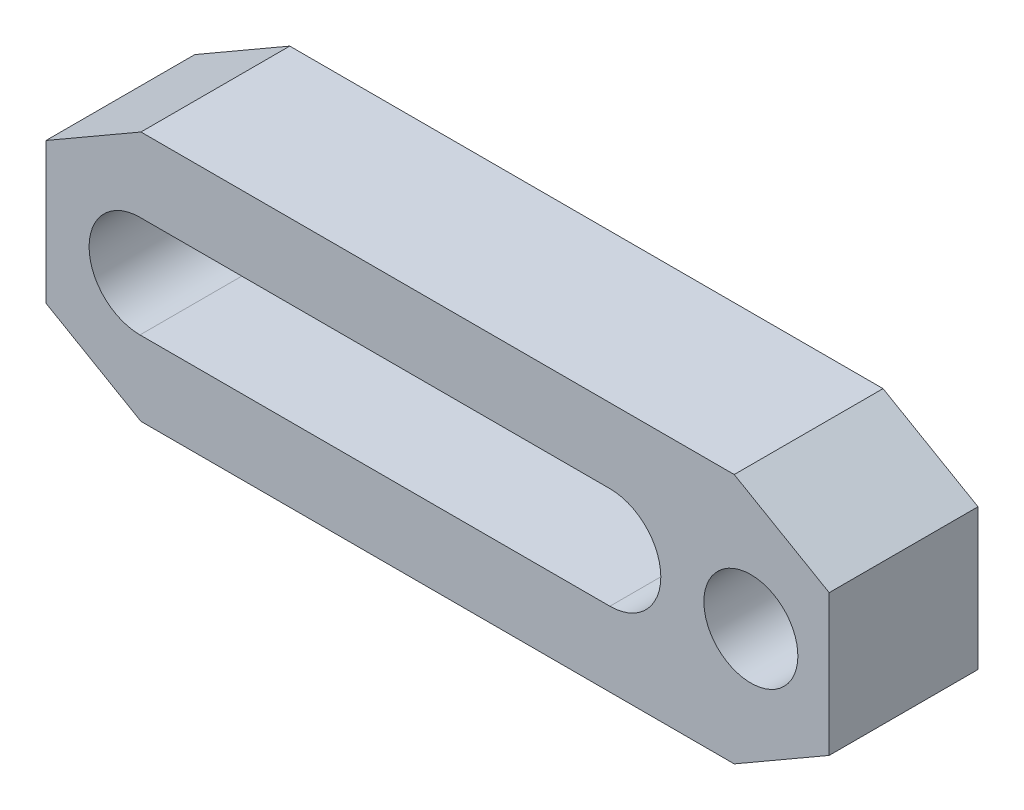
ISO-10303-21;
HEADER;
FILE_DESCRIPTION(('STEP AP214'),'2;1');
FILE_NAME('part.step','',(''),(''),'','','');
FILE_SCHEMA(('AUTOMOTIVE_DESIGN { 1 0 10303 214 1 1 1 1 }'));
ENDSEC;
DATA;
#1=APPLICATION_CONTEXT('core data for automotive mechanical design processes');
#2=APPLICATION_PROTOCOL_DEFINITION('international standard','automotive_design',2000,#1);
#3=PRODUCT_CONTEXT('',#1,'mechanical');
#4=PRODUCT('Part','Part','',(#3));
#5=PRODUCT_RELATED_PRODUCT_CATEGORY('part','',(#4));
#6=PRODUCT_DEFINITION_FORMATION('','',#4);
#7=PRODUCT_DEFINITION_CONTEXT('part definition',#1,'design');
#8=PRODUCT_DEFINITION('design','',#6,#7);
#9=PRODUCT_DEFINITION_SHAPE('','',#8);
#10=(LENGTH_UNIT() NAMED_UNIT(*) SI_UNIT(.MILLI.,.METRE.));
#11=(NAMED_UNIT(*) PLANE_ANGLE_UNIT() SI_UNIT($,.RADIAN.));
#12=(NAMED_UNIT(*) SI_UNIT($,.STERADIAN.) SOLID_ANGLE_UNIT());
#13=UNCERTAINTY_MEASURE_WITH_UNIT(LENGTH_MEASURE(1.E-05),#10,'distance_accuracy_value','');
#14=(GEOMETRIC_REPRESENTATION_CONTEXT(3) GLOBAL_UNCERTAINTY_ASSIGNED_CONTEXT((#13)) GLOBAL_UNIT_ASSIGNED_CONTEXT((#10,
#11,#12)) REPRESENTATION_CONTEXT('',''));
#15=CARTESIAN_POINT('',(0.,0.,0.));
#16=DIRECTION('',(0.,0.,1.));
#17=DIRECTION('',(1.,0.,0.));
#18=AXIS2_PLACEMENT_3D('',#15,#16,#17);
#19=CARTESIAN_POINT('',(-22.,37.8675134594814,19.));
#20=DIRECTION('',(0.,0.,1.));
#21=DIRECTION('',(0.,1.,0.));
#22=AXIS2_PLACEMENT_3D('',#19,#20,#21);
#23=PLANE('',#22);
#24=CARTESIAN_POINT('',(18.,0.,19.));
#25=DIRECTION('',(0.,0.,1.));
#26=DIRECTION('',(0.,1.,0.));
#27=AXIS2_PLACEMENT_3D('',#24,#25,#26);
#28=CIRCLE('',#27,6.);
#29=CARTESIAN_POINT('',(18.,6.,19.));
#30=VERTEX_POINT('',#29);
#31=EDGE_CURVE('E124',#30,#30,#28,.T.);
#32=ORIENTED_EDGE('',*,*,#31,.F.);
#33=EDGE_LOOP('',(#32));
#34=FACE_BOUND('',#33,.T.);
#35=DIRECTION('',(-0.866025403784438,-0.5,0.));
#36=VECTOR('',#35,1.);
#37=CARTESIAN_POINT('',(-72.,9.,19.));
#38=LINE('',#37,#36);
#39=CARTESIAN_POINT('',(-59.8756443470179,16.,19.));
#40=VERTEX_POINT('',#39);
#41=CARTESIAN_POINT('',(-72.,9.,19.));
#42=VERTEX_POINT('',#41);
#43=EDGE_CURVE('E160',#40,#42,#38,.T.);
#44=ORIENTED_EDGE('',*,*,#43,.T.);
#45=DIRECTION('',(0.,-1.,0.));
#46=VECTOR('',#45,1.);
#47=CARTESIAN_POINT('',(-72.,-9.,19.));
#48=LINE('',#47,#46);
#49=CARTESIAN_POINT('',(-72.,-9.,19.));
#50=VERTEX_POINT('',#49);
#51=EDGE_CURVE('E163',#42,#50,#48,.T.);
#52=ORIENTED_EDGE('',*,*,#51,.T.);
#53=DIRECTION('',(0.866025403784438,-0.5,0.));
#54=VECTOR('',#53,1.);
#55=CARTESIAN_POINT('',(-72.,-9.,19.));
#56=LINE('',#55,#54);
#57=CARTESIAN_POINT('',(-59.8756443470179,-16.,19.));
#58=VERTEX_POINT('',#57);
#59=EDGE_CURVE('E165',#50,#58,#56,.T.);
#60=ORIENTED_EDGE('',*,*,#59,.T.);
#61=DIRECTION('',(1.,0.,0.));
#62=VECTOR('',#61,1.);
#63=CARTESIAN_POINT('',(15.8756443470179,-16.,19.));
#64=LINE('',#63,#62);
#65=CARTESIAN_POINT('',(15.8756443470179,-16.,19.));
#66=VERTEX_POINT('',#65);
#67=EDGE_CURVE('E167',#58,#66,#64,.T.);
#68=ORIENTED_EDGE('',*,*,#67,.T.);
#69=DIRECTION('',(0.866025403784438,0.5,0.));
#70=VECTOR('',#69,1.);
#71=CARTESIAN_POINT('',(28.,-9.,19.));
#72=LINE('',#71,#70);
#73=CARTESIAN_POINT('',(28.,-9.,19.));
#74=VERTEX_POINT('',#73);
#75=EDGE_CURVE('E169',#66,#74,#72,.T.);
#76=ORIENTED_EDGE('',*,*,#75,.T.);
#77=DIRECTION('',(0.,1.,0.));
#78=VECTOR('',#77,1.);
#79=CARTESIAN_POINT('',(28.,-9.,19.));
#80=LINE('',#79,#78);
#81=CARTESIAN_POINT('',(28.,9.,19.));
#82=VERTEX_POINT('',#81);
#83=EDGE_CURVE('E171',#74,#82,#80,.T.);
#84=ORIENTED_EDGE('',*,*,#83,.T.);
#85=DIRECTION('',(-0.866025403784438,0.5,0.));
#86=VECTOR('',#85,1.);
#87=CARTESIAN_POINT('',(28.,9.,19.));
#88=LINE('',#87,#86);
#89=CARTESIAN_POINT('',(15.8756443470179,16.,19.));
#90=VERTEX_POINT('',#89);
#91=EDGE_CURVE('E173',#82,#90,#88,.T.);
#92=ORIENTED_EDGE('',*,*,#91,.T.);
#93=DIRECTION('',(-1.,0.,0.));
#94=VECTOR('',#93,1.);
#95=CARTESIAN_POINT('',(15.8756443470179,16.,19.));
#96=LINE('',#95,#94);
#97=EDGE_CURVE('E175',#90,#40,#96,.T.);
#98=ORIENTED_EDGE('',*,*,#97,.T.);
#99=EDGE_LOOP('',(#44,#52,#60,#68,#76,#84,#92,#98));
#100=FACE_BOUND('',#99,.T.);
#101=DIRECTION('',(-1.,0.,0.));
#102=VECTOR('',#101,1.);
#103=CARTESIAN_POINT('',(0.,6.5,19.));
#104=LINE('',#103,#102);
#105=CARTESIAN_POINT('',(0.,6.5,19.));
#106=VERTEX_POINT('',#105);
#107=CARTESIAN_POINT('',(-60.,6.5,19.));
#108=VERTEX_POINT('',#107);
#109=EDGE_CURVE('E134',#106,#108,#104,.T.);
#110=ORIENTED_EDGE('',*,*,#109,.F.);
#111=CARTESIAN_POINT('',(0.,0.,19.));
#112=DIRECTION('',(0.,0.,1.));
#113=DIRECTION('',(0.,1.,0.));
#114=AXIS2_PLACEMENT_3D('',#111,#112,#113);
#115=CIRCLE('',#114,6.5);
#116=CARTESIAN_POINT('',(0.,-6.5,19.));
#117=VERTEX_POINT('',#116);
#118=EDGE_CURVE('E118',#117,#106,#115,.T.);
#119=ORIENTED_EDGE('',*,*,#118,.F.);
#120=DIRECTION('',(1.,0.,0.));
#121=VECTOR('',#120,1.);
#122=CARTESIAN_POINT('',(0.,-6.5,19.));
#123=LINE('',#122,#121);
#124=CARTESIAN_POINT('',(-60.,-6.5,19.));
#125=VERTEX_POINT('',#124);
#126=EDGE_CURVE('E138',#125,#117,#123,.T.);
#127=ORIENTED_EDGE('',*,*,#126,.F.);
#128=CARTESIAN_POINT('',(-60.,0.,19.));
#129=DIRECTION('',(0.,0.,1.));
#130=DIRECTION('',(0.,1.,0.));
#131=AXIS2_PLACEMENT_3D('',#128,#129,#130);
#132=CIRCLE('',#131,6.5);
#133=EDGE_CURVE('E136',#108,#125,#132,.T.);
#134=ORIENTED_EDGE('',*,*,#133,.F.);
#135=EDGE_LOOP('',(#110,#119,#127,#134));
#136=FACE_BOUND('',#135,.T.);
#137=ADVANCED_FACE('F14',(#34,#100,#136),#23,.T.);
#138=CARTESIAN_POINT('',(-22.,37.8675134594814,0.));
#139=DIRECTION('',(0.,0.,1.));
#140=DIRECTION('',(0.,1.,0.));
#141=AXIS2_PLACEMENT_3D('',#138,#139,#140);
#142=PLANE('',#141);
#143=CARTESIAN_POINT('',(18.,0.,0.));
#144=DIRECTION('',(0.,0.,1.));
#145=DIRECTION('',(0.,1.,0.));
#146=AXIS2_PLACEMENT_3D('',#143,#144,#145);
#147=CIRCLE('',#146,6.);
#148=CARTESIAN_POINT('',(18.,6.,0.));
#149=VERTEX_POINT('',#148);
#150=EDGE_CURVE('E127',#149,#149,#147,.T.);
#151=ORIENTED_EDGE('',*,*,#150,.T.);
#152=EDGE_LOOP('',(#151));
#153=FACE_BOUND('',#152,.T.);
#154=DIRECTION('',(-0.866025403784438,-0.5,0.));
#155=VECTOR('',#154,1.);
#156=CARTESIAN_POINT('',(-72.,9.,0.));
#157=LINE('',#156,#155);
#158=CARTESIAN_POINT('',(-59.8756443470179,16.,0.));
#159=VERTEX_POINT('',#158);
#160=CARTESIAN_POINT('',(-72.,9.,0.));
#161=VERTEX_POINT('',#160);
#162=EDGE_CURVE('E119',#159,#161,#157,.T.);
#163=ORIENTED_EDGE('',*,*,#162,.F.);
#164=DIRECTION('',(-1.,0.,0.));
#165=VECTOR('',#164,1.);
#166=CARTESIAN_POINT('',(15.8756443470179,16.,0.));
#167=LINE('',#166,#165);
#168=CARTESIAN_POINT('',(15.8756443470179,16.,0.));
#169=VERTEX_POINT('',#168);
#170=EDGE_CURVE('E158',#169,#159,#167,.T.);
#171=ORIENTED_EDGE('',*,*,#170,.F.);
#172=DIRECTION('',(-0.866025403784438,0.5,0.));
#173=VECTOR('',#172,1.);
#174=CARTESIAN_POINT('',(28.,9.,0.));
#175=LINE('',#174,#173);
#176=CARTESIAN_POINT('',(28.,9.,0.));
#177=VERTEX_POINT('',#176);
#178=EDGE_CURVE('E156',#177,#169,#175,.T.);
#179=ORIENTED_EDGE('',*,*,#178,.F.);
#180=DIRECTION('',(0.,1.,0.));
#181=VECTOR('',#180,1.);
#182=CARTESIAN_POINT('',(28.,-9.,0.));
#183=LINE('',#182,#181);
#184=CARTESIAN_POINT('',(28.,-9.,0.));
#185=VERTEX_POINT('',#184);
#186=EDGE_CURVE('E154',#185,#177,#183,.T.);
#187=ORIENTED_EDGE('',*,*,#186,.F.);
#188=DIRECTION('',(0.866025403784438,0.5,0.));
#189=VECTOR('',#188,1.);
#190=CARTESIAN_POINT('',(28.,-9.,0.));
#191=LINE('',#190,#189);
#192=CARTESIAN_POINT('',(15.8756443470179,-16.,0.));
#193=VERTEX_POINT('',#192);
#194=EDGE_CURVE('E152',#193,#185,#191,.T.);
#195=ORIENTED_EDGE('',*,*,#194,.F.);
#196=DIRECTION('',(1.,0.,0.));
#197=VECTOR('',#196,1.);
#198=CARTESIAN_POINT('',(15.8756443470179,-16.,0.));
#199=LINE('',#198,#197);
#200=CARTESIAN_POINT('',(-59.8756443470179,-16.,0.));
#201=VERTEX_POINT('',#200);
#202=EDGE_CURVE('E150',#201,#193,#199,.T.);
#203=ORIENTED_EDGE('',*,*,#202,.F.);
#204=DIRECTION('',(0.866025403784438,-0.5,0.));
#205=VECTOR('',#204,1.);
#206=CARTESIAN_POINT('',(-72.,-9.,0.));
#207=LINE('',#206,#205);
#208=CARTESIAN_POINT('',(-72.,-9.,0.));
#209=VERTEX_POINT('',#208);
#210=EDGE_CURVE('E148',#209,#201,#207,.T.);
#211=ORIENTED_EDGE('',*,*,#210,.F.);
#212=DIRECTION('',(0.,-1.,0.));
#213=VECTOR('',#212,1.);
#214=CARTESIAN_POINT('',(-72.,-9.,0.));
#215=LINE('',#214,#213);
#216=EDGE_CURVE('E146',#161,#209,#215,.T.);
#217=ORIENTED_EDGE('',*,*,#216,.F.);
#218=EDGE_LOOP('',(#163,#171,#179,#187,#195,#203,#211,#217));
#219=FACE_BOUND('',#218,.T.);
#220=CARTESIAN_POINT('',(0.,0.,0.));
#221=DIRECTION('',(0.,0.,1.));
#222=DIRECTION('',(0.,1.,0.));
#223=AXIS2_PLACEMENT_3D('',#220,#221,#222);
#224=CIRCLE('',#223,6.5);
#225=CARTESIAN_POINT('',(0.,-6.5,0.));
#226=VERTEX_POINT('',#225);
#227=CARTESIAN_POINT('',(0.,6.5,0.));
#228=VERTEX_POINT('',#227);
#229=EDGE_CURVE('E37',#226,#228,#224,.T.);
#230=ORIENTED_EDGE('',*,*,#229,.T.);
#231=DIRECTION('',(-1.,0.,0.));
#232=VECTOR('',#231,1.);
#233=CARTESIAN_POINT('',(0.,6.5,0.));
#234=LINE('',#233,#232);
#235=CARTESIAN_POINT('',(-60.,6.5,0.));
#236=VERTEX_POINT('',#235);
#237=EDGE_CURVE('E105',#228,#236,#234,.T.);
#238=ORIENTED_EDGE('',*,*,#237,.T.);
#239=CARTESIAN_POINT('',(-60.,0.,0.));
#240=DIRECTION('',(0.,0.,1.));
#241=DIRECTION('',(0.,1.,0.));
#242=AXIS2_PLACEMENT_3D('',#239,#240,#241);
#243=CIRCLE('',#242,6.5);
#244=CARTESIAN_POINT('',(-60.,-6.5,0.));
#245=VERTEX_POINT('',#244);
#246=EDGE_CURVE('E114',#236,#245,#243,.T.);
#247=ORIENTED_EDGE('',*,*,#246,.T.);
#248=DIRECTION('',(1.,0.,0.));
#249=VECTOR('',#248,1.);
#250=CARTESIAN_POINT('',(0.,-6.5,0.));
#251=LINE('',#250,#249);
#252=EDGE_CURVE('E123',#245,#226,#251,.T.);
#253=ORIENTED_EDGE('',*,*,#252,.T.);
#254=EDGE_LOOP('',(#230,#238,#247,#253));
#255=FACE_BOUND('',#254,.T.);
#256=ADVANCED_FACE('F122',(#153,#219,#255),#142,.F.);
#257=CARTESIAN_POINT('',(-72.,9.,19.));
#258=DIRECTION('',(0.5,-0.866025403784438,0.));
#259=DIRECTION('',(0.866025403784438,0.5,0.));
#260=AXIS2_PLACEMENT_3D('',#257,#258,#259);
#261=PLANE('',#260);
#262=ORIENTED_EDGE('',*,*,#162,.T.);
#263=DIRECTION('',(0.,0.,-1.));
#264=VECTOR('',#263,1.);
#265=CARTESIAN_POINT('',(-72.,9.,19.));
#266=LINE('',#265,#264);
#267=EDGE_CURVE('E9',#42,#161,#266,.T.);
#268=ORIENTED_EDGE('',*,*,#267,.F.);
#269=ORIENTED_EDGE('',*,*,#43,.F.);
#270=DIRECTION('',(0.,0.,-1.));
#271=VECTOR('',#270,1.);
#272=CARTESIAN_POINT('',(-59.8756443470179,16.,19.));
#273=LINE('',#272,#271);
#274=EDGE_CURVE('E177',#40,#159,#273,.T.);
#275=ORIENTED_EDGE('',*,*,#274,.T.);
#276=EDGE_LOOP('',(#262,#268,#269,#275));
#277=FACE_BOUND('',#276,.T.);
#278=ADVANCED_FACE('F16',(#277),#261,.F.);
#279=CARTESIAN_POINT('',(-72.,-9.,19.));
#280=DIRECTION('',(1.,0.,0.));
#281=DIRECTION('',(0.,1.,0.));
#282=AXIS2_PLACEMENT_3D('',#279,#280,#281);
#283=PLANE('',#282);
#284=ORIENTED_EDGE('',*,*,#216,.T.);
#285=DIRECTION('',(0.,0.,-1.));
#286=VECTOR('',#285,1.);
#287=CARTESIAN_POINT('',(-72.,-9.,19.));
#288=LINE('',#287,#286);
#289=EDGE_CURVE('E22',#50,#209,#288,.T.);
#290=ORIENTED_EDGE('',*,*,#289,.F.);
#291=ORIENTED_EDGE('',*,*,#51,.F.);
#292=ORIENTED_EDGE('',*,*,#267,.T.);
#293=EDGE_LOOP('',(#284,#290,#291,#292));
#294=FACE_BOUND('',#293,.T.);
#295=ADVANCED_FACE('F221',(#294),#283,.F.);
#296=CARTESIAN_POINT('',(-72.,-9.,19.));
#297=DIRECTION('',(0.5,0.866025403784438,0.));
#298=DIRECTION('',(-0.866025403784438,0.5,0.));
#299=AXIS2_PLACEMENT_3D('',#296,#297,#298);
#300=PLANE('',#299);
#301=ORIENTED_EDGE('',*,*,#210,.T.);
#302=DIRECTION('',(0.,0.,-1.));
#303=VECTOR('',#302,1.);
#304=CARTESIAN_POINT('',(-59.8756443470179,-16.,19.));
#305=LINE('',#304,#303);
#306=EDGE_CURVE('E192',#58,#201,#305,.T.);
#307=ORIENTED_EDGE('',*,*,#306,.F.);
#308=ORIENTED_EDGE('',*,*,#59,.F.);
#309=ORIENTED_EDGE('',*,*,#289,.T.);
#310=EDGE_LOOP('',(#301,#307,#308,#309));
#311=FACE_BOUND('',#310,.T.);
#312=ADVANCED_FACE('F199',(#311),#300,.F.);
#313=CARTESIAN_POINT('',(15.8756443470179,-16.,19.));
#314=DIRECTION('',(0.,1.,0.));
#315=DIRECTION('',(-1.,0.,0.));
#316=AXIS2_PLACEMENT_3D('',#313,#314,#315);
#317=PLANE('',#316);
#318=ORIENTED_EDGE('',*,*,#202,.T.);
#319=DIRECTION('',(0.,0.,-1.));
#320=VECTOR('',#319,1.);
#321=CARTESIAN_POINT('',(15.8756443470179,-16.,19.));
#322=LINE('',#321,#320);
#323=EDGE_CURVE('E189',#66,#193,#322,.T.);
#324=ORIENTED_EDGE('',*,*,#323,.F.);
#325=ORIENTED_EDGE('',*,*,#67,.F.);
#326=ORIENTED_EDGE('',*,*,#306,.T.);
#327=EDGE_LOOP('',(#318,#324,#325,#326));
#328=FACE_BOUND('',#327,.T.);
#329=ADVANCED_FACE('F209',(#328),#317,.F.);
#330=CARTESIAN_POINT('',(28.,-9.,19.));
#331=DIRECTION('',(-0.5,0.866025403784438,0.));
#332=DIRECTION('',(-0.866025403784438,-0.5,0.));
#333=AXIS2_PLACEMENT_3D('',#330,#331,#332);
#334=PLANE('',#333);
#335=ORIENTED_EDGE('',*,*,#194,.T.);
#336=DIRECTION('',(0.,0.,-1.));
#337=VECTOR('',#336,1.);
#338=CARTESIAN_POINT('',(28.,-9.,19.));
#339=LINE('',#338,#337);
#340=EDGE_CURVE('E186',#74,#185,#339,.T.);
#341=ORIENTED_EDGE('',*,*,#340,.F.);
#342=ORIENTED_EDGE('',*,*,#75,.F.);
#343=ORIENTED_EDGE('',*,*,#323,.T.);
#344=EDGE_LOOP('',(#335,#341,#342,#343));
#345=FACE_BOUND('',#344,.T.);
#346=ADVANCED_FACE('F213',(#345),#334,.F.);
#347=CARTESIAN_POINT('',(28.,-9.,19.));
#348=DIRECTION('',(-1.,0.,0.));
#349=DIRECTION('',(0.,-1.,0.));
#350=AXIS2_PLACEMENT_3D('',#347,#348,#349);
#351=PLANE('',#350);
#352=ORIENTED_EDGE('',*,*,#186,.T.);
#353=DIRECTION('',(0.,0.,-1.));
#354=VECTOR('',#353,1.);
#355=CARTESIAN_POINT('',(28.,9.,19.));
#356=LINE('',#355,#354);
#357=EDGE_CURVE('E183',#82,#177,#356,.T.);
#358=ORIENTED_EDGE('',*,*,#357,.F.);
#359=ORIENTED_EDGE('',*,*,#83,.F.);
#360=ORIENTED_EDGE('',*,*,#340,.T.);
#361=EDGE_LOOP('',(#352,#358,#359,#360));
#362=FACE_BOUND('',#361,.T.);
#363=ADVANCED_FACE('F234',(#362),#351,.F.);
#364=CARTESIAN_POINT('',(28.,9.,19.));
#365=DIRECTION('',(-0.5,-0.866025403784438,0.));
#366=DIRECTION('',(0.866025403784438,-0.5,0.));
#367=AXIS2_PLACEMENT_3D('',#364,#365,#366);
#368=PLANE('',#367);
#369=ORIENTED_EDGE('',*,*,#178,.T.);
#370=DIRECTION('',(0.,0.,-1.));
#371=VECTOR('',#370,1.);
#372=CARTESIAN_POINT('',(15.8756443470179,16.,19.));
#373=LINE('',#372,#371);
#374=EDGE_CURVE('E180',#90,#169,#373,.T.);
#375=ORIENTED_EDGE('',*,*,#374,.F.);
#376=ORIENTED_EDGE('',*,*,#91,.F.);
#377=ORIENTED_EDGE('',*,*,#357,.T.);
#378=EDGE_LOOP('',(#369,#375,#376,#377));
#379=FACE_BOUND('',#378,.T.);
#380=ADVANCED_FACE('F232',(#379),#368,.F.);
#381=CARTESIAN_POINT('',(15.8756443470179,16.,19.));
#382=DIRECTION('',(0.,-1.,0.));
#383=DIRECTION('',(1.,0.,0.));
#384=AXIS2_PLACEMENT_3D('',#381,#382,#383);
#385=PLANE('',#384);
#386=ORIENTED_EDGE('',*,*,#170,.T.);
#387=ORIENTED_EDGE('',*,*,#274,.F.);
#388=ORIENTED_EDGE('',*,*,#97,.F.);
#389=ORIENTED_EDGE('',*,*,#374,.T.);
#390=EDGE_LOOP('',(#386,#387,#388,#389));
#391=FACE_BOUND('',#390,.T.);
#392=ADVANCED_FACE('F227',(#391),#385,.F.);
#393=CARTESIAN_POINT('',(0.,0.,19.));
#394=DIRECTION('',(0.,0.,-1.));
#395=DIRECTION('',(0.,-1.,0.));
#396=AXIS2_PLACEMENT_3D('',#393,#394,#395);
#397=CYLINDRICAL_SURFACE('',#396,6.5);
#398=ORIENTED_EDGE('',*,*,#229,.F.);
#399=DIRECTION('',(0.,0.,-1.));
#400=VECTOR('',#399,1.);
#401=CARTESIAN_POINT('',(0.,-6.5,19.));
#402=LINE('',#401,#400);
#403=EDGE_CURVE('E140',#117,#226,#402,.T.);
#404=ORIENTED_EDGE('',*,*,#403,.F.);
#405=ORIENTED_EDGE('',*,*,#118,.T.);
#406=DIRECTION('',(0.,0.,-1.));
#407=VECTOR('',#406,1.);
#408=CARTESIAN_POINT('',(0.,6.5,19.));
#409=LINE('',#408,#407);
#410=EDGE_CURVE('E107',#106,#228,#409,.T.);
#411=ORIENTED_EDGE('',*,*,#410,.T.);
#412=EDGE_LOOP('',(#398,#404,#405,#411));
#413=FACE_BOUND('',#412,.T.);
#414=ADVANCED_FACE('F116',(#413),#397,.F.);
#415=CARTESIAN_POINT('',(0.,6.5,19.));
#416=DIRECTION('',(0.,-1.,0.));
#417=DIRECTION('',(1.,0.,0.));
#418=AXIS2_PLACEMENT_3D('',#415,#416,#417);
#419=PLANE('',#418);
#420=ORIENTED_EDGE('',*,*,#237,.F.);
#421=ORIENTED_EDGE('',*,*,#410,.F.);
#422=ORIENTED_EDGE('',*,*,#109,.T.);
#423=DIRECTION('',(0.,0.,-1.));
#424=VECTOR('',#423,1.);
#425=CARTESIAN_POINT('',(-60.,6.5,19.));
#426=LINE('',#425,#424);
#427=EDGE_CURVE('E110',#108,#236,#426,.T.);
#428=ORIENTED_EDGE('',*,*,#427,.T.);
#429=EDGE_LOOP('',(#420,#421,#422,#428));
#430=FACE_BOUND('',#429,.T.);
#431=ADVANCED_FACE('F106',(#430),#419,.T.);
#432=CARTESIAN_POINT('',(-60.,0.,19.));
#433=DIRECTION('',(0.,0.,-1.));
#434=DIRECTION('',(0.,-1.,0.));
#435=AXIS2_PLACEMENT_3D('',#432,#433,#434);
#436=CYLINDRICAL_SURFACE('',#435,6.5);
#437=ORIENTED_EDGE('',*,*,#246,.F.);
#438=ORIENTED_EDGE('',*,*,#427,.F.);
#439=ORIENTED_EDGE('',*,*,#133,.T.);
#440=DIRECTION('',(0.,0.,-1.));
#441=VECTOR('',#440,1.);
#442=CARTESIAN_POINT('',(-60.,-6.5,19.));
#443=LINE('',#442,#441);
#444=EDGE_CURVE('E29',#125,#245,#443,.T.);
#445=ORIENTED_EDGE('',*,*,#444,.T.);
#446=EDGE_LOOP('',(#437,#438,#439,#445));
#447=FACE_BOUND('',#446,.T.);
#448=ADVANCED_FACE('F262',(#447),#436,.F.);
#449=CARTESIAN_POINT('',(0.,-6.5,19.));
#450=DIRECTION('',(0.,1.,0.));
#451=DIRECTION('',(-1.,0.,0.));
#452=AXIS2_PLACEMENT_3D('',#449,#450,#451);
#453=PLANE('',#452);
#454=ORIENTED_EDGE('',*,*,#252,.F.);
#455=ORIENTED_EDGE('',*,*,#444,.F.);
#456=ORIENTED_EDGE('',*,*,#126,.T.);
#457=ORIENTED_EDGE('',*,*,#403,.T.);
#458=EDGE_LOOP('',(#454,#455,#456,#457));
#459=FACE_BOUND('',#458,.T.);
#460=ADVANCED_FACE('F267',(#459),#453,.T.);
#461=CARTESIAN_POINT('',(18.,0.,19.));
#462=DIRECTION('',(0.,0.,1.));
#463=DIRECTION('',(0.,1.,0.));
#464=AXIS2_PLACEMENT_3D('',#461,#462,#463);
#465=CYLINDRICAL_SURFACE('',#464,6.);
#466=ORIENTED_EDGE('',*,*,#150,.F.);
#467=EDGE_LOOP('',(#466));
#468=FACE_BOUND('',#467,.T.);
#469=ORIENTED_EDGE('',*,*,#31,.T.);
#470=EDGE_LOOP('',(#469));
#471=FACE_BOUND('',#470,.T.);
#472=ADVANCED_FACE('F271',(#468,#471),#465,.F.);
#473=CLOSED_SHELL('',(#137,#256,#278,#295,#312,#329,#346,#363,#380,#392,#414,#431,#448,#460,#472));
#474=MANIFOLD_SOLID_BREP('B1',#473);
#475=ADVANCED_BREP_SHAPE_REPRESENTATION('',(#18,#474),#14);
#476=SHAPE_DEFINITION_REPRESENTATION(#9,#475);
ENDSEC;
END-ISO-10303-21;
